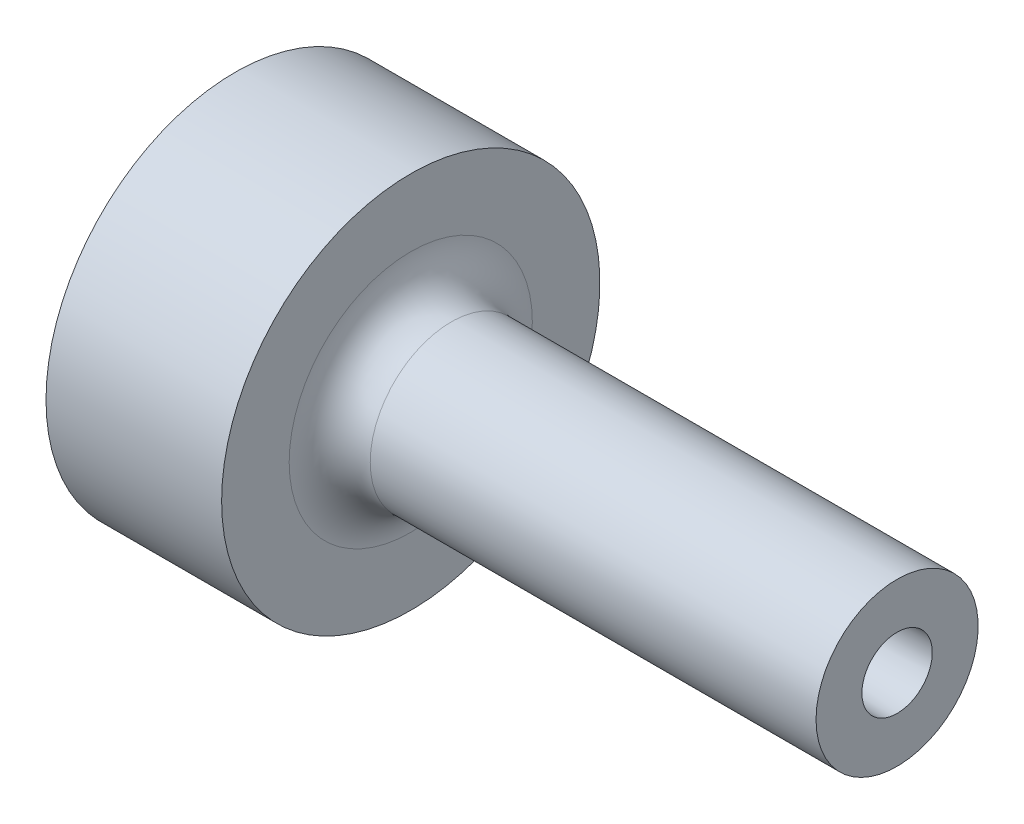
ISO-10303-21;
HEADER;
FILE_DESCRIPTION(('STEP AP214'),'2;1');
FILE_NAME('part.step','',(''),(''),'','','');
FILE_SCHEMA(('AUTOMOTIVE_DESIGN { 1 0 10303 214 1 1 1 1 }'));
ENDSEC;
DATA;
#1=APPLICATION_CONTEXT('core data for automotive mechanical design processes');
#2=APPLICATION_PROTOCOL_DEFINITION('international standard','automotive_design',2000,#1);
#3=PRODUCT_CONTEXT('',#1,'mechanical');
#4=PRODUCT('Part','Part','',(#3));
#5=PRODUCT_RELATED_PRODUCT_CATEGORY('part','',(#4));
#6=PRODUCT_DEFINITION_FORMATION('','',#4);
#7=PRODUCT_DEFINITION_CONTEXT('part definition',#1,'design');
#8=PRODUCT_DEFINITION('design','',#6,#7);
#9=PRODUCT_DEFINITION_SHAPE('','',#8);
#10=(LENGTH_UNIT() NAMED_UNIT(*) SI_UNIT(.MILLI.,.METRE.));
#11=(NAMED_UNIT(*) PLANE_ANGLE_UNIT() SI_UNIT($,.RADIAN.));
#12=(NAMED_UNIT(*) SI_UNIT($,.STERADIAN.) SOLID_ANGLE_UNIT());
#13=UNCERTAINTY_MEASURE_WITH_UNIT(LENGTH_MEASURE(1.E-05),#10,'distance_accuracy_value','');
#14=(GEOMETRIC_REPRESENTATION_CONTEXT(3) GLOBAL_UNCERTAINTY_ASSIGNED_CONTEXT((#13)) GLOBAL_UNIT_ASSIGNED_CONTEXT((#10,
#11,#12)) REPRESENTATION_CONTEXT('',''));
#15=CARTESIAN_POINT('',(0.,0.,0.));
#16=DIRECTION('',(0.,0.,1.));
#17=DIRECTION('',(1.,0.,0.));
#18=AXIS2_PLACEMENT_3D('',#15,#16,#17);
#19=CARTESIAN_POINT('',(0.,0.,0.));
#20=DIRECTION('',(-1.,0.,0.));
#21=DIRECTION('',(0.,0.,1.));
#22=AXIS2_PLACEMENT_3D('',#19,#20,#21);
#23=CYLINDRICAL_SURFACE('',#22,14.);
#24=CARTESIAN_POINT('',(13.,0.,0.));
#25=DIRECTION('',(-1.,0.,0.));
#26=DIRECTION('',(0.,0.,1.));
#27=AXIS2_PLACEMENT_3D('',#24,#25,#26);
#28=CIRCLE('',#27,14.);
#29=CARTESIAN_POINT('',(13.,0.,14.));
#30=VERTEX_POINT('',#29);
#31=EDGE_CURVE('E88',#30,#30,#28,.T.);
#32=ORIENTED_EDGE('',*,*,#31,.T.);
#33=EDGE_LOOP('',(#32));
#34=FACE_BOUND('',#33,.T.);
#35=CARTESIAN_POINT('',(0.,0.,0.));
#36=DIRECTION('',(-1.,0.,0.));
#37=DIRECTION('',(0.,0.,1.));
#38=AXIS2_PLACEMENT_3D('',#35,#36,#37);
#39=CIRCLE('',#38,14.);
#40=CARTESIAN_POINT('',(0.,0.,14.));
#41=VERTEX_POINT('',#40);
#42=EDGE_CURVE('E83',#41,#41,#39,.T.);
#43=ORIENTED_EDGE('',*,*,#42,.F.);
#44=EDGE_LOOP('',(#43));
#45=FACE_BOUND('',#44,.T.);
#46=CARTESIAN_POINT('',(6.5,-13.856406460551,-2.));
#47=CARTESIAN_POINT('',(6.61172417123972,-13.8564082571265,-1.99999534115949));
#48=CARTESIAN_POINT('',(6.72351471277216,-13.8577723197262,-1.99060664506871));
#49=CARTESIAN_POINT('',(6.9439746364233,-13.8630779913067,-1.95330740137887));
#50=CARTESIAN_POINT('',(7.05264079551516,-13.8670221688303,-1.92537839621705));
#51=CARTESIAN_POINT('',(7.26362870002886,-13.8770324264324,-1.85184738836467));
#52=CARTESIAN_POINT('',(7.36595507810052,-13.8830969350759,-1.80625847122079));
#53=CARTESIAN_POINT('',(7.56148972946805,-13.8966626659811,-1.69873175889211));
#54=CARTESIAN_POINT('',(7.65469934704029,-13.9041636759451,-1.63679637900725));
#55=CARTESIAN_POINT('',(7.83004829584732,-13.9198182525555,-1.49785346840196));
#56=CARTESIAN_POINT('',(7.91211171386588,-13.9279757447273,-1.42075056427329));
#57=CARTESIAN_POINT('',(8.06218155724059,-13.9439890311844,-1.25386707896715));
#58=CARTESIAN_POINT('',(8.13018723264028,-13.9518448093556,-1.16408582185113));
#59=CARTESIAN_POINT('',(8.25048909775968,-13.9664103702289,-0.973910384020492));
#60=CARTESIAN_POINT('',(8.30271571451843,-13.9731150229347,-0.873471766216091));
#61=CARTESIAN_POINT('',(8.38953073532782,-13.9845795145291,-0.665136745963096));
#62=CARTESIAN_POINT('',(8.4241199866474,-13.9893394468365,-0.557240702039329));
#63=CARTESIAN_POINT('',(8.47444920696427,-13.9963505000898,-0.337834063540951));
#64=CARTESIAN_POINT('',(8.49031606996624,-13.9986185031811,-0.226353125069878));
#65=CARTESIAN_POINT('',(8.5031438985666,-14.0004479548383,-0.00228956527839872));
#66=CARTESIAN_POINT('',(8.50010582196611,-14.0000095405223,0.110292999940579));
#67=CARTESIAN_POINT('',(8.47531062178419,-13.9964890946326,0.33249899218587));
#68=CARTESIAN_POINT('',(8.45369000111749,-13.9934263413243,0.442137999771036));
#69=CARTESIAN_POINT('',(8.39255744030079,-13.9850228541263,0.656215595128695));
#70=CARTESIAN_POINT('',(8.3530450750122,-13.9796820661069,0.760654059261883));
#71=CARTESIAN_POINT('',(8.25710925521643,-13.9672894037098,0.961781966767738));
#72=CARTESIAN_POINT('',(8.20062784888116,-13.9602316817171,1.05844339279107));
#73=CARTESIAN_POINT('',(8.07239950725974,-13.9451926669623,1.24096782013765));
#74=CARTESIAN_POINT('',(8.00065165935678,-13.9372113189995,1.32683017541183));
#75=CARTESIAN_POINT('',(7.843165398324,-13.921132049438,1.48612299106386));
#76=CARTESIAN_POINT('',(7.75730786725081,-13.9130337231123,1.55943569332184));
#77=CARTESIAN_POINT('',(7.57444547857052,-13.8977029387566,1.69062989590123));
#78=CARTESIAN_POINT('',(7.47744056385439,-13.890470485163,1.74851131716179));
#79=CARTESIAN_POINT('',(7.27491971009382,-13.8776905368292,1.84721301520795));
#80=CARTESIAN_POINT('',(7.1693981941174,-13.8721441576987,1.88802200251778));
#81=CARTESIAN_POINT('',(6.95290242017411,-13.8633846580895,1.9513062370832));
#82=CARTESIAN_POINT('',(6.84192850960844,-13.8601713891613,1.97378265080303));
#83=CARTESIAN_POINT('',(6.61872346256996,-13.8564698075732,1.99960390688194));
#84=CARTESIAN_POINT('',(6.50651197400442,-13.8559577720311,2.00311531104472));
#85=CARTESIAN_POINT('',(6.28310219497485,-13.8576537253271,1.9913480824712));
#86=CARTESIAN_POINT('',(6.17190387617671,-13.8598616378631,1.9760699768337));
#87=CARTESIAN_POINT('',(5.95418781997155,-13.8667269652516,1.92729837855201));
#88=CARTESIAN_POINT('',(5.84765127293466,-13.8713733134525,1.8938871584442));
#89=CARTESIAN_POINT('',(5.6416912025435,-13.8825829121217,1.80988306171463));
#90=CARTESIAN_POINT('',(5.54226800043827,-13.8891462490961,1.75928940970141));
#91=CARTESIAN_POINT('',(5.35260812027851,-13.9035064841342,1.64195360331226));
#92=CARTESIAN_POINT('',(5.26243903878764,-13.911311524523,1.57510320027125));
#93=CARTESIAN_POINT('',(5.09454027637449,-13.9272509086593,1.42730277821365));
#94=CARTESIAN_POINT('',(5.01681123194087,-13.9353852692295,1.34635203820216));
#95=CARTESIAN_POINT('',(4.8754047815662,-13.9511405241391,1.17191708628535));
#96=CARTESIAN_POINT('',(4.81183747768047,-13.9587570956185,1.07834317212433));
#97=CARTESIAN_POINT('',(4.70132443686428,-13.972552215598,0.881748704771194));
#98=CARTESIAN_POINT('',(4.65437828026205,-13.9787308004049,0.778728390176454));
#99=CARTESIAN_POINT('',(4.57861788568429,-13.9889347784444,0.566515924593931));
#100=CARTESIAN_POINT('',(4.54974241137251,-13.9929674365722,0.457345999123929));
#101=CARTESIAN_POINT('',(4.51074453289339,-13.9984555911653,0.235645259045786));
#102=CARTESIAN_POINT('',(4.50062101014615,-13.9999112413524,0.123114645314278));
#103=CARTESIAN_POINT('',(4.49943976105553,-14.0000800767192,-0.101043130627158));
#104=CARTESIAN_POINT('',(4.50821318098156,-13.998817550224,-0.212669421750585));
#105=CARTESIAN_POINT('',(4.54421615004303,-13.9937406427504,-0.432842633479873));
#106=CARTESIAN_POINT('',(4.57144565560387,-13.989926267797,-0.541389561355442));
#107=CARTESIAN_POINT('',(4.6435299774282,-13.9801722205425,-0.752283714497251));
#108=CARTESIAN_POINT('',(4.68837418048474,-13.9742338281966,-0.854634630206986));
#109=CARTESIAN_POINT('',(4.79439714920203,-13.960885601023,-1.05038570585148));
#110=CARTESIAN_POINT('',(4.8555763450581,-13.9534757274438,-1.14378562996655));
#111=CARTESIAN_POINT('',(4.99314771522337,-13.9379304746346,-1.31984194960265));
#112=CARTESIAN_POINT('',(5.06966490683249,-13.9297894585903,-1.40240016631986));
#113=CARTESIAN_POINT('',(5.2354775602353,-13.9137422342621,-1.55356716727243));
#114=CARTESIAN_POINT('',(5.32477602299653,-13.9058360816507,-1.6221726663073));
#115=CARTESIAN_POINT('',(5.51414543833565,-13.8911108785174,-1.74379523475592));
#116=CARTESIAN_POINT('',(5.61426869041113,-13.8842975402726,-1.79673154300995));
#117=CARTESIAN_POINT('',(5.82203229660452,-13.8725962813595,-1.88495902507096));
#118=CARTESIAN_POINT('',(5.92966459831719,-13.8677063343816,-1.92026877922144));
#119=CARTESIAN_POINT('',(6.11483642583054,-13.8615529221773,-1.96409255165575));
#120=CARTESIAN_POINT('',(6.19122433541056,-13.859633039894,-1.97753762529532));
#121=CARTESIAN_POINT('',(6.34506419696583,-13.857059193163,-1.99549291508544));
#122=CARTESIAN_POINT('',(6.42251613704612,-13.8564052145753,-2.00000323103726));
#123=CARTESIAN_POINT('',(6.5,-13.856406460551,-2.));
#124=B_SPLINE_CURVE_WITH_KNOTS('',3,(#46,#47,#48,#49,#50,#51,#52,#53,#54,#55,#56,#57,#58,#59,
#60,#61,#62,#63,#64,#65,#66,#67,#68,#69,#70,#71,#72,#73,#74,#75,#76,#77,#78,#79,#80,#81,#82,#83,
#84,#85,#86,#87,#88,#89,#90,#91,#92,#93,#94,#95,#96,#97,#98,#99,#100,#101,#102,#103,#104,#105,
#106,#107,#108,#109,#110,#111,#112,#113,#114,#115,#116,#117,#118,#119,#120,#121,#122,#123),
.UNSPECIFIED.,.T.,.F.,(4,2,2,2,2,2,2,2,2,2,2,2,2,2,2,2,2,2,2,2,2,2,2,2,2,2,2,2,2,2,2,2,2,2,2,2,
2,2,4),(0.,0.334889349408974,0.670112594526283,1.00508792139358,1.34001378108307,
1.6771171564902,2.01423851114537,2.35282530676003,2.6913958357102,3.02765822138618,
3.36390357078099,3.69769984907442,4.03150405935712,4.36646147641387,4.70143892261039,
5.03940517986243,5.37737316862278,5.7155642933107,6.05373389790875,6.3889286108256,
6.72411392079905,7.05779100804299,7.39148315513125,7.72746121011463,8.06345644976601,
8.40197921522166,8.74049343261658,9.07785422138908,9.41519488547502,9.74953375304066,
10.083871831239,10.4180087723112,10.7521545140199,11.0891434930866,11.426211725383,
11.7649881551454,12.103406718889,12.3356645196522,12.5679197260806),.UNSPECIFIED.);
#125=CARTESIAN_POINT('',(6.5,-13.856406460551,-2.));
#126=VERTEX_POINT('',#125);
#127=EDGE_CURVE('E9',#126,#126,#124,.T.);
#128=ORIENTED_EDGE('',*,*,#127,.F.);
#129=EDGE_LOOP('',(#128));
#130=FACE_BOUND('',#129,.T.);
#131=ADVANCED_FACE('F15',(#34,#45,#130),#23,.T.);
#132=CARTESIAN_POINT('',(0.,0.,0.));
#133=DIRECTION('',(1.,0.,0.));
#134=DIRECTION('',(0.,0.,-1.));
#135=AXIS2_PLACEMENT_3D('',#132,#133,#134);
#136=CONICAL_SURFACE('',#135,1.75,0.0174532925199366);
#137=CARTESIAN_POINT('',(49.,0.,0.));
#138=DIRECTION('',(-1.,0.,0.));
#139=DIRECTION('',(0.,0.,1.));
#140=AXIS2_PLACEMENT_3D('',#137,#138,#139);
#141=CIRCLE('',#140,2.60529818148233);
#142=CARTESIAN_POINT('',(49.,0.,2.60529818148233));
#143=VERTEX_POINT('',#142);
#144=EDGE_CURVE('E80',#143,#143,#141,.T.);
#145=ORIENTED_EDGE('',*,*,#144,.F.);
#146=EDGE_LOOP('',(#145));
#147=FACE_BOUND('',#146,.T.);
#148=CARTESIAN_POINT('',(1.08679639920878,0.,0.));
#149=DIRECTION('',(-1.,0.,0.));
#150=DIRECTION('',(0.,0.,1.));
#151=AXIS2_PLACEMENT_3D('',#148,#149,#150);
#152=CIRCLE('',#151,1.76897010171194);
#153=CARTESIAN_POINT('',(1.08679639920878,0.,1.76897010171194));
#154=VERTEX_POINT('',#153);
#155=EDGE_CURVE('E93',#154,#154,#152,.F.);
#156=ORIENTED_EDGE('',*,*,#155,.F.);
#157=EDGE_LOOP('',(#156));
#158=FACE_BOUND('',#157,.T.);
#159=ADVANCED_FACE('F44',(#147,#158),#136,.F.);
#160=CARTESIAN_POINT('',(16.,0.,0.));
#161=DIRECTION('',(-1.,0.,0.));
#162=DIRECTION('',(0.,0.,1.));
#163=AXIS2_PLACEMENT_3D('',#160,#161,#162);
#164=TOROIDAL_SURFACE('',#163,9.,3.);
#165=CARTESIAN_POINT('',(13.,0.,0.));
#166=DIRECTION('',(-1.,0.,0.));
#167=DIRECTION('',(0.,0.,1.));
#168=AXIS2_PLACEMENT_3D('',#165,#166,#167);
#169=CIRCLE('',#168,9.);
#170=CARTESIAN_POINT('',(13.,0.,9.));
#171=VERTEX_POINT('',#170);
#172=EDGE_CURVE('E90',#171,#171,#169,.T.);
#173=ORIENTED_EDGE('',*,*,#172,.F.);
#174=EDGE_LOOP('',(#173));
#175=FACE_BOUND('',#174,.T.);
#176=CARTESIAN_POINT('',(16.,0.,0.));
#177=DIRECTION('',(-1.,0.,0.));
#178=DIRECTION('',(0.,0.,1.));
#179=AXIS2_PLACEMENT_3D('',#176,#177,#178);
#180=CIRCLE('',#179,6.);
#181=CARTESIAN_POINT('',(16.,0.,6.));
#182=VERTEX_POINT('',#181);
#183=EDGE_CURVE('E27',#182,#182,#180,.T.);
#184=ORIENTED_EDGE('',*,*,#183,.T.);
#185=EDGE_LOOP('',(#184));
#186=FACE_BOUND('',#185,.T.);
#187=ADVANCED_FACE('F17',(#175,#186),#164,.F.);
#188=CARTESIAN_POINT('',(0.,0.,0.));
#189=DIRECTION('',(-1.,0.,0.));
#190=DIRECTION('',(0.,0.,1.));
#191=AXIS2_PLACEMENT_3D('',#188,#189,#190);
#192=CYLINDRICAL_SURFACE('',#191,6.);
#193=ORIENTED_EDGE('',*,*,#183,.F.);
#194=EDGE_LOOP('',(#193));
#195=FACE_BOUND('',#194,.T.);
#196=CARTESIAN_POINT('',(49.,0.,0.));
#197=DIRECTION('',(-1.,0.,0.));
#198=DIRECTION('',(0.,0.,1.));
#199=AXIS2_PLACEMENT_3D('',#196,#197,#198);
#200=CIRCLE('',#199,6.);
#201=CARTESIAN_POINT('',(49.,0.,6.));
#202=VERTEX_POINT('',#201);
#203=EDGE_CURVE('E79',#202,#202,#200,.T.);
#204=ORIENTED_EDGE('',*,*,#203,.T.);
#205=EDGE_LOOP('',(#204));
#206=FACE_BOUND('',#205,.T.);
#207=ADVANCED_FACE('F65',(#195,#206),#192,.T.);
#208=CARTESIAN_POINT('',(49.,6.,0.));
#209=DIRECTION('',(-1.,0.,0.));
#210=DIRECTION('',(0.,0.,1.));
#211=AXIS2_PLACEMENT_3D('',#208,#209,#210);
#212=PLANE('',#211);
#213=ORIENTED_EDGE('',*,*,#203,.F.);
#214=EDGE_LOOP('',(#213));
#215=FACE_BOUND('',#214,.T.);
#216=ORIENTED_EDGE('',*,*,#144,.T.);
#217=EDGE_LOOP('',(#216));
#218=FACE_BOUND('',#217,.T.);
#219=ADVANCED_FACE('F61',(#215,#218),#212,.F.);
#220=CARTESIAN_POINT('',(0.,1.75,0.));
#221=DIRECTION('',(1.,0.,0.));
#222=DIRECTION('',(0.,0.,-1.));
#223=AXIS2_PLACEMENT_3D('',#220,#221,#222);
#224=PLANE('',#223);
#225=CARTESIAN_POINT('',(0.,0.,0.));
#226=DIRECTION('',(-1.,0.,0.));
#227=DIRECTION('',(0.,0.,1.));
#228=AXIS2_PLACEMENT_3D('',#225,#226,#227);
#229=CIRCLE('',#228,5.);
#230=CARTESIAN_POINT('',(0.,0.,5.));
#231=VERTEX_POINT('',#230);
#232=EDGE_CURVE('E96',#231,#231,#229,.T.);
#233=ORIENTED_EDGE('',*,*,#232,.F.);
#234=EDGE_LOOP('',(#233));
#235=FACE_BOUND('',#234,.T.);
#236=ORIENTED_EDGE('',*,*,#42,.T.);
#237=EDGE_LOOP('',(#236));
#238=FACE_BOUND('',#237,.T.);
#239=ADVANCED_FACE('F59',(#235,#238),#224,.F.);
#240=CARTESIAN_POINT('',(13.,14.,0.));
#241=DIRECTION('',(-1.,0.,0.));
#242=DIRECTION('',(0.,0.,1.));
#243=AXIS2_PLACEMENT_3D('',#240,#241,#242);
#244=PLANE('',#243);
#245=ORIENTED_EDGE('',*,*,#31,.F.);
#246=EDGE_LOOP('',(#245));
#247=FACE_BOUND('',#246,.T.);
#248=ORIENTED_EDGE('',*,*,#172,.T.);
#249=EDGE_LOOP('',(#248));
#250=FACE_BOUND('',#249,.T.);
#251=ADVANCED_FACE('F57',(#247,#250),#244,.F.);
#252=CARTESIAN_POINT('',(-37.3349076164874,0.,0.));
#253=DIRECTION('',(-1.,0.,0.));
#254=DIRECTION('',(0.,0.,1.));
#255=AXIS2_PLACEMENT_3D('',#252,#253,#254);
#256=DEGENERATE_TOROIDAL_SURFACE('',#255,9.35634609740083,40.,.F.);
#257=ORIENTED_EDGE('',*,*,#232,.T.);
#258=EDGE_LOOP('',(#257));
#259=FACE_BOUND('',#258,.T.);
#260=ORIENTED_EDGE('',*,*,#155,.T.);
#261=EDGE_LOOP('',(#260));
#262=FACE_BOUND('',#261,.T.);
#263=ADVANCED_FACE('F40',(#259,#262),#256,.T.);
#264=CARTESIAN_POINT('',(6.5,-14.,0.));
#265=DIRECTION('',(0.,-1.,0.));
#266=DIRECTION('',(0.,0.,-1.));
#267=AXIS2_PLACEMENT_3D('',#264,#265,#266);
#268=CYLINDRICAL_SURFACE('',#267,2.);
#269=CARTESIAN_POINT('',(6.5,-8.,0.));
#270=DIRECTION('',(0.,-1.,0.));
#271=DIRECTION('',(0.,0.,-1.));
#272=AXIS2_PLACEMENT_3D('',#269,#270,#271);
#273=CIRCLE('',#272,2.);
#274=CARTESIAN_POINT('',(6.5,-8.,-2.));
#275=VERTEX_POINT('',#274);
#276=EDGE_CURVE('E99',#275,#275,#273,.T.);
#277=ORIENTED_EDGE('',*,*,#276,.F.);
#278=EDGE_LOOP('',(#277));
#279=FACE_BOUND('',#278,.T.);
#280=ORIENTED_EDGE('',*,*,#127,.T.);
#281=EDGE_LOOP('',(#280));
#282=FACE_BOUND('',#281,.T.);
#283=ADVANCED_FACE('F32',(#279,#282),#268,.F.);
#284=CARTESIAN_POINT('',(6.5,-6.84529946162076,0.));
#285=DIRECTION('',(0.,-1.,0.));
#286=DIRECTION('',(0.,0.,-1.));
#287=AXIS2_PLACEMENT_3D('',#284,#285,#286);
#288=CONICAL_SURFACE('',#287,0.,1.0471975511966);
#289=ORIENTED_EDGE('',*,*,#276,.T.);
#290=EDGE_LOOP('',(#289));
#291=FACE_BOUND('',#290,.T.);
#292=CARTESIAN_POINT('',(6.5,-6.84529946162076,0.));
#293=VERTEX_POINT('',#292);
#294=VERTEX_LOOP('',#293);
#295=FACE_BOUND('',#294,.T.);
#296=ADVANCED_FACE('F30',(#291,#295),#288,.F.);
#297=CLOSED_SHELL('',(#131,#159,#187,#207,#219,#239,#251,#263,#283,#296));
#298=MANIFOLD_SOLID_BREP('B1',#297);
#299=ADVANCED_BREP_SHAPE_REPRESENTATION('',(#18,#298),#14);
#300=SHAPE_DEFINITION_REPRESENTATION(#9,#299);
ENDSEC;
END-ISO-10303-21;
